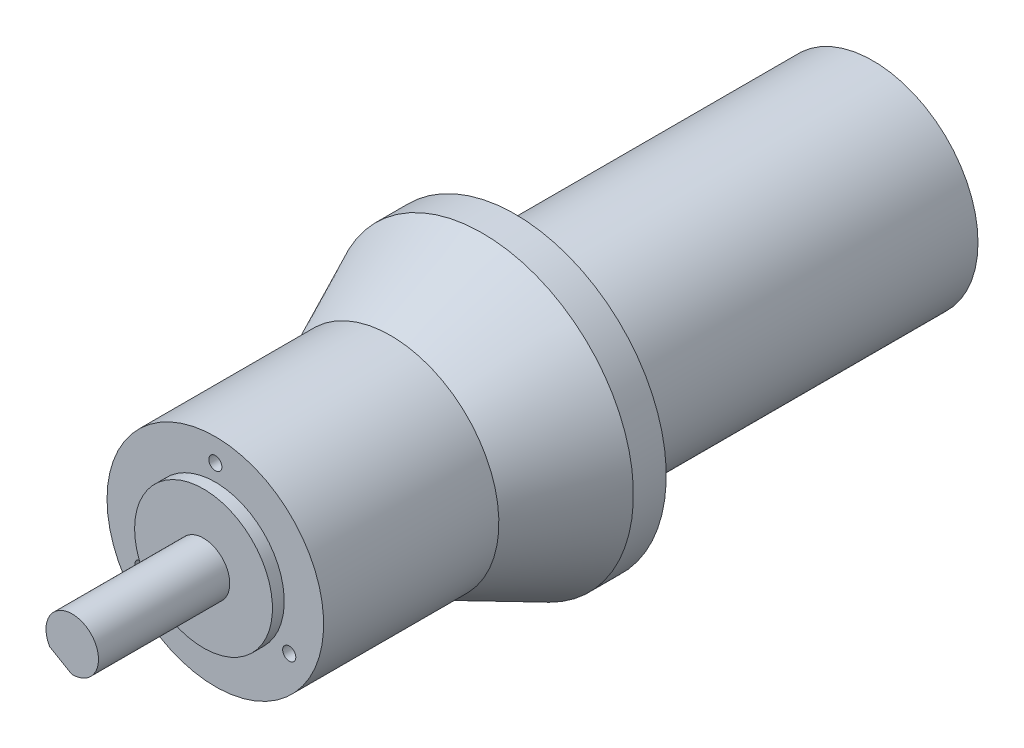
ISO-10303-21;
HEADER;
FILE_DESCRIPTION(('STEP AP214'),'2;1');
FILE_NAME('part.step','',(''),(''),'','','');
FILE_SCHEMA(('AUTOMOTIVE_DESIGN { 1 0 10303 214 1 1 1 1 }'));
ENDSEC;
DATA;
#1=APPLICATION_CONTEXT('core data for automotive mechanical design processes');
#2=APPLICATION_PROTOCOL_DEFINITION('international standard','automotive_design',2000,#1);
#3=PRODUCT_CONTEXT('',#1,'mechanical');
#4=PRODUCT('Part','Part','',(#3));
#5=PRODUCT_RELATED_PRODUCT_CATEGORY('part','',(#4));
#6=PRODUCT_DEFINITION_FORMATION('','',#4);
#7=PRODUCT_DEFINITION_CONTEXT('part definition',#1,'design');
#8=PRODUCT_DEFINITION('design','',#6,#7);
#9=PRODUCT_DEFINITION_SHAPE('','',#8);
#10=(LENGTH_UNIT() NAMED_UNIT(*) SI_UNIT(.MILLI.,.METRE.));
#11=(NAMED_UNIT(*) PLANE_ANGLE_UNIT() SI_UNIT($,.RADIAN.));
#12=(NAMED_UNIT(*) SI_UNIT($,.STERADIAN.) SOLID_ANGLE_UNIT());
#13=UNCERTAINTY_MEASURE_WITH_UNIT(LENGTH_MEASURE(1.E-05),#10,'distance_accuracy_value','');
#14=(GEOMETRIC_REPRESENTATION_CONTEXT(3) GLOBAL_UNCERTAINTY_ASSIGNED_CONTEXT((#13)) GLOBAL_UNIT_ASSIGNED_CONTEXT((#10,
#11,#12)) REPRESENTATION_CONTEXT('',''));
#15=CARTESIAN_POINT('',(0.,0.,0.));
#16=DIRECTION('',(0.,0.,1.));
#17=DIRECTION('',(1.,0.,0.));
#18=AXIS2_PLACEMENT_3D('',#15,#16,#17);
#19=CARTESIAN_POINT('',(6.910254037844,-8.031088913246,21.8));
#20=DIRECTION('',(0.500000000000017,0.866025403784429,0.));
#21=DIRECTION('',(-0.866025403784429,0.500000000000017,0.));
#22=AXIS2_PLACEMENT_3D('',#19,#20,#21);
#23=PLANE('',#22);
#24=DIRECTION('',(-0.866025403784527,0.499999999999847,0.));
#25=VECTOR('',#24,1.);
#26=CARTESIAN_POINT('',(-0.07294901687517,-3.999334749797,3.8));
#27=LINE('',#26,#25);
#28=CARTESIAN_POINT('',(-0.0729490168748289,-3.99933474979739,3.8));
#29=VERTEX_POINT('',#28);
#30=CARTESIAN_POINT('',(-3.4270509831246,-2.06284307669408,3.8));
#31=VERTEX_POINT('',#30);
#32=EDGE_CURVE('E34',#29,#31,#27,.T.);
#33=ORIENTED_EDGE('',*,*,#32,.F.);
#34=DIRECTION('',(0.,0.,-1.));
#35=VECTOR('',#34,1.);
#36=CARTESIAN_POINT('',(-0.0729490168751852,-3.99933474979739,22.89));
#37=LINE('',#36,#35);
#38=CARTESIAN_POINT('',(-0.0729490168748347,-3.99933474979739,21.8));
#39=VERTEX_POINT('',#38);
#40=EDGE_CURVE('E51',#39,#29,#37,.T.);
#41=ORIENTED_EDGE('',*,*,#40,.F.);
#42=DIRECTION('',(-0.866025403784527,0.499999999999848,0.));
#43=VECTOR('',#42,1.);
#44=CARTESIAN_POINT('',(-0.07294901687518,-3.999334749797,21.8));
#45=LINE('',#44,#43);
#46=CARTESIAN_POINT('',(-3.4270509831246,-2.06284307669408,21.8));
#47=VERTEX_POINT('',#46);
#48=EDGE_CURVE('E47',#39,#47,#45,.T.);
#49=ORIENTED_EDGE('',*,*,#48,.T.);
#50=DIRECTION('',(0.,0.,-1.));
#51=VECTOR('',#50,1.);
#52=CARTESIAN_POINT('',(-3.42705098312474,-2.06284307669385,22.89));
#53=LINE('',#52,#51);
#54=EDGE_CURVE('E41',#31,#47,#53,.F.);
#55=ORIENTED_EDGE('',*,*,#54,.F.);
#56=EDGE_LOOP('',(#33,#41,#49,#55));
#57=FACE_BOUND('',#56,.T.);
#58=ADVANCED_FACE('F16',(#57),#23,.F.);
#59=CARTESIAN_POINT('',(0.,0.,3.8));
#60=DIRECTION('',(0.,0.,1.));
#61=DIRECTION('',(1.,0.,0.));
#62=AXIS2_PLACEMENT_3D('',#59,#60,#61);
#63=PLANE('',#62);
#64=CARTESIAN_POINT('',(0.,0.,3.8));
#65=DIRECTION('',(0.,0.,-1.));
#66=DIRECTION('',(-1.,0.,0.));
#67=AXIS2_PLACEMENT_3D('',#64,#65,#66);
#68=CIRCLE('',#67,4.);
#69=EDGE_CURVE('E19',#29,#31,#68,.T.);
#70=ORIENTED_EDGE('',*,*,#69,.F.);
#71=ORIENTED_EDGE('',*,*,#32,.T.);
#72=EDGE_LOOP('',(#70,#71));
#73=FACE_BOUND('',#72,.T.);
#74=ADVANCED_FACE('F132',(#73),#63,.T.);
#75=CARTESIAN_POINT('',(0.,0.,21.8));
#76=DIRECTION('',(0.,0.,-1.));
#77=DIRECTION('',(-1.,0.,0.));
#78=AXIS2_PLACEMENT_3D('',#75,#76,#77);
#79=PLANE('',#78);
#80=CARTESIAN_POINT('',(0.,0.,21.8));
#81=DIRECTION('',(0.,0.,-1.));
#82=DIRECTION('',(-1.,0.,0.));
#83=AXIS2_PLACEMENT_3D('',#80,#81,#82);
#84=CIRCLE('',#83,4.);
#85=EDGE_CURVE('E45',#47,#39,#84,.T.);
#86=ORIENTED_EDGE('',*,*,#85,.F.);
#87=ORIENTED_EDGE('',*,*,#48,.F.);
#88=EDGE_LOOP('',(#86,#87));
#89=FACE_BOUND('',#88,.T.);
#90=ADVANCED_FACE('F46',(#89),#79,.F.);
#91=CARTESIAN_POINT('',(0.,0.,22.89));
#92=DIRECTION('',(0.,0.,-1.));
#93=DIRECTION('',(-1.,0.,0.));
#94=AXIS2_PLACEMENT_3D('',#91,#92,#93);
#95=CYLINDRICAL_SURFACE('',#94,4.);
#96=CARTESIAN_POINT('',(0.,0.,1.8));
#97=DIRECTION('',(0.,0.,-1.));
#98=DIRECTION('',(-1.,0.,0.));
#99=AXIS2_PLACEMENT_3D('',#96,#97,#98);
#100=CIRCLE('',#99,4.);
#101=CARTESIAN_POINT('',(-4.,0.,1.8));
#102=VERTEX_POINT('',#101);
#103=EDGE_CURVE('E50',#102,#102,#100,.F.);
#104=ORIENTED_EDGE('',*,*,#103,.T.);
#105=EDGE_LOOP('',(#104));
#106=FACE_BOUND('',#105,.T.);
#107=ORIENTED_EDGE('',*,*,#85,.T.);
#108=ORIENTED_EDGE('',*,*,#40,.T.);
#109=ORIENTED_EDGE('',*,*,#69,.T.);
#110=ORIENTED_EDGE('',*,*,#54,.T.);
#111=EDGE_LOOP('',(#107,#108,#109,#110));
#112=FACE_BOUND('',#111,.T.);
#113=ADVANCED_FACE('F54',(#106,#112),#95,.T.);
#114=CARTESIAN_POINT('',(0.,0.,1.8));
#115=DIRECTION('',(0.,0.,-1.));
#116=DIRECTION('',(-1.,0.,0.));
#117=AXIS2_PLACEMENT_3D('',#114,#115,#116);
#118=PLANE('',#117);
#119=ORIENTED_EDGE('',*,*,#103,.F.);
#120=EDGE_LOOP('',(#119));
#121=FACE_BOUND('',#120,.T.);
#122=CARTESIAN_POINT('',(0.,0.,1.8));
#123=DIRECTION('',(0.,0.,-1.));
#124=DIRECTION('',(-1.,0.,0.));
#125=AXIS2_PLACEMENT_3D('',#122,#123,#124);
#126=CIRCLE('',#125,10.5);
#127=CARTESIAN_POINT('',(-10.5,0.,1.8));
#128=VERTEX_POINT('',#127);
#129=EDGE_CURVE('E90',#128,#128,#126,.T.);
#130=ORIENTED_EDGE('',*,*,#129,.F.);
#131=EDGE_LOOP('',(#130));
#132=FACE_BOUND('',#131,.T.);
#133=ADVANCED_FACE('F97',(#121,#132),#118,.F.);
#134=CARTESIAN_POINT('',(-11.2583302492,-6.5,-6.));
#135=DIRECTION('',(0.,0.,-1.));
#136=DIRECTION('',(-1.,0.,0.));
#137=AXIS2_PLACEMENT_3D('',#134,#135,#136);
#138=PLANE('',#137);
#139=CARTESIAN_POINT('',(-11.2583302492,-6.5,-6.));
#140=DIRECTION('',(0.,0.,-1.));
#141=DIRECTION('',(-1.,0.,0.));
#142=AXIS2_PLACEMENT_3D('',#139,#140,#141);
#143=CIRCLE('',#142,1.);
#144=CARTESIAN_POINT('',(-12.2583302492,-6.5,-6.));
#145=VERTEX_POINT('',#144);
#146=EDGE_CURVE('E87',#145,#145,#143,.F.);
#147=ORIENTED_EDGE('',*,*,#146,.T.);
#148=EDGE_LOOP('',(#147));
#149=FACE_BOUND('',#148,.T.);
#150=ADVANCED_FACE('F100',(#149),#138,.F.);
#151=CARTESIAN_POINT('',(11.2583302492,-6.5,-6.));
#152=DIRECTION('',(0.,0.,-1.));
#153=DIRECTION('',(-1.,0.,0.));
#154=AXIS2_PLACEMENT_3D('',#151,#152,#153);
#155=PLANE('',#154);
#156=CARTESIAN_POINT('',(11.2583302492,-6.5,-6.));
#157=DIRECTION('',(0.,0.,-1.));
#158=DIRECTION('',(-1.,0.,0.));
#159=AXIS2_PLACEMENT_3D('',#156,#157,#158);
#160=CIRCLE('',#159,1.);
#161=CARTESIAN_POINT('',(10.2583302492,-6.5,-6.));
#162=VERTEX_POINT('',#161);
#163=EDGE_CURVE('E84',#162,#162,#160,.F.);
#164=ORIENTED_EDGE('',*,*,#163,.T.);
#165=EDGE_LOOP('',(#164));
#166=FACE_BOUND('',#165,.T.);
#167=ADVANCED_FACE('F174',(#166),#155,.F.);
#168=CARTESIAN_POINT('',(0.,13.,-6.));
#169=DIRECTION('',(0.,0.,-1.));
#170=DIRECTION('',(-1.,0.,0.));
#171=AXIS2_PLACEMENT_3D('',#168,#169,#170);
#172=PLANE('',#171);
#173=CARTESIAN_POINT('',(0.,13.,-6.));
#174=DIRECTION('',(0.,0.,-1.));
#175=DIRECTION('',(-1.,0.,0.));
#176=AXIS2_PLACEMENT_3D('',#173,#174,#175);
#177=CIRCLE('',#176,1.);
#178=CARTESIAN_POINT('',(-1.,13.,-6.));
#179=VERTEX_POINT('',#178);
#180=EDGE_CURVE('E81',#179,#179,#177,.F.);
#181=ORIENTED_EDGE('',*,*,#180,.T.);
#182=EDGE_LOOP('',(#181));
#183=FACE_BOUND('',#182,.T.);
#184=ADVANCED_FACE('F108',(#183),#172,.F.);
#185=CARTESIAN_POINT('',(0.,0.,22.89));
#186=DIRECTION('',(0.,0.,-1.));
#187=DIRECTION('',(-1.,0.,0.));
#188=AXIS2_PLACEMENT_3D('',#185,#186,#187);
#189=CYLINDRICAL_SURFACE('',#188,10.5);
#190=ORIENTED_EDGE('',*,*,#129,.T.);
#191=EDGE_LOOP('',(#190));
#192=FACE_BOUND('',#191,.T.);
#193=CARTESIAN_POINT('',(0.,0.,0.));
#194=DIRECTION('',(0.,0.,-1.));
#195=DIRECTION('',(-1.,0.,0.));
#196=AXIS2_PLACEMENT_3D('',#193,#194,#195);
#197=CIRCLE('',#196,10.5);
#198=CARTESIAN_POINT('',(-10.5,0.,0.));
#199=VERTEX_POINT('',#198);
#200=EDGE_CURVE('E78',#199,#199,#197,.F.);
#201=ORIENTED_EDGE('',*,*,#200,.T.);
#202=EDGE_LOOP('',(#201));
#203=FACE_BOUND('',#202,.T.);
#204=ADVANCED_FACE('F104',(#192,#203),#189,.T.);
#205=CARTESIAN_POINT('',(-11.2583302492,-6.5,0.));
#206=DIRECTION('',(0.,0.,-1.));
#207=DIRECTION('',(-1.,0.,0.));
#208=AXIS2_PLACEMENT_3D('',#205,#206,#207);
#209=CYLINDRICAL_SURFACE('',#208,1.);
#210=ORIENTED_EDGE('',*,*,#146,.F.);
#211=EDGE_LOOP('',(#210));
#212=FACE_BOUND('',#211,.T.);
#213=CARTESIAN_POINT('',(-11.2583302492,-6.5,0.));
#214=DIRECTION('',(0.,0.,-1.));
#215=DIRECTION('',(-1.,0.,0.));
#216=AXIS2_PLACEMENT_3D('',#213,#214,#215);
#217=CIRCLE('',#216,1.);
#218=CARTESIAN_POINT('',(-12.2583302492,-6.5,0.));
#219=VERTEX_POINT('',#218);
#220=EDGE_CURVE('E75',#219,#219,#217,.F.);
#221=ORIENTED_EDGE('',*,*,#220,.T.);
#222=EDGE_LOOP('',(#221));
#223=FACE_BOUND('',#222,.T.);
#224=ADVANCED_FACE('F107',(#212,#223),#209,.F.);
#225=CARTESIAN_POINT('',(11.2583302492,-6.5,0.));
#226=DIRECTION('',(0.,0.,-1.));
#227=DIRECTION('',(-1.,0.,0.));
#228=AXIS2_PLACEMENT_3D('',#225,#226,#227);
#229=CYLINDRICAL_SURFACE('',#228,1.);
#230=ORIENTED_EDGE('',*,*,#163,.F.);
#231=EDGE_LOOP('',(#230));
#232=FACE_BOUND('',#231,.T.);
#233=CARTESIAN_POINT('',(11.2583302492,-6.5,0.));
#234=DIRECTION('',(0.,0.,-1.));
#235=DIRECTION('',(-1.,0.,0.));
#236=AXIS2_PLACEMENT_3D('',#233,#234,#235);
#237=CIRCLE('',#236,1.);
#238=CARTESIAN_POINT('',(10.2583302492,-6.5,0.));
#239=VERTEX_POINT('',#238);
#240=EDGE_CURVE('E72',#239,#239,#237,.F.);
#241=ORIENTED_EDGE('',*,*,#240,.T.);
#242=EDGE_LOOP('',(#241));
#243=FACE_BOUND('',#242,.T.);
#244=ADVANCED_FACE('F164',(#232,#243),#229,.F.);
#245=CARTESIAN_POINT('',(0.,13.,0.));
#246=DIRECTION('',(0.,0.,-1.));
#247=DIRECTION('',(-1.,0.,0.));
#248=AXIS2_PLACEMENT_3D('',#245,#246,#247);
#249=CYLINDRICAL_SURFACE('',#248,1.);
#250=ORIENTED_EDGE('',*,*,#180,.F.);
#251=EDGE_LOOP('',(#250));
#252=FACE_BOUND('',#251,.T.);
#253=CARTESIAN_POINT('',(0.,13.,0.));
#254=DIRECTION('',(0.,0.,-1.));
#255=DIRECTION('',(-1.,0.,0.));
#256=AXIS2_PLACEMENT_3D('',#253,#254,#255);
#257=CIRCLE('',#256,1.);
#258=CARTESIAN_POINT('',(-1.,13.,0.));
#259=VERTEX_POINT('',#258);
#260=EDGE_CURVE('E69',#259,#259,#257,.F.);
#261=ORIENTED_EDGE('',*,*,#260,.T.);
#262=EDGE_LOOP('',(#261));
#263=FACE_BOUND('',#262,.T.);
#264=ADVANCED_FACE('F116',(#252,#263),#249,.F.);
#265=CARTESIAN_POINT('',(0.,0.,0.));
#266=DIRECTION('',(0.,0.,-1.));
#267=DIRECTION('',(-1.,0.,0.));
#268=AXIS2_PLACEMENT_3D('',#265,#266,#267);
#269=PLANE('',#268);
#270=ORIENTED_EDGE('',*,*,#260,.F.);
#271=EDGE_LOOP('',(#270));
#272=FACE_BOUND('',#271,.T.);
#273=ORIENTED_EDGE('',*,*,#240,.F.);
#274=EDGE_LOOP('',(#273));
#275=FACE_BOUND('',#274,.T.);
#276=ORIENTED_EDGE('',*,*,#220,.F.);
#277=EDGE_LOOP('',(#276));
#278=FACE_BOUND('',#277,.T.);
#279=ORIENTED_EDGE('',*,*,#200,.F.);
#280=EDGE_LOOP('',(#279));
#281=FACE_BOUND('',#280,.T.);
#282=CARTESIAN_POINT('',(0.,0.,0.));
#283=DIRECTION('',(0.,0.,-1.));
#284=DIRECTION('',(-1.,0.,0.));
#285=AXIS2_PLACEMENT_3D('',#282,#283,#284);
#286=CIRCLE('',#285,16.5);
#287=CARTESIAN_POINT('',(-16.5,0.,0.));
#288=VERTEX_POINT('',#287);
#289=EDGE_CURVE('E65',#288,#288,#286,.T.);
#290=ORIENTED_EDGE('',*,*,#289,.F.);
#291=EDGE_LOOP('',(#290));
#292=FACE_BOUND('',#291,.T.);
#293=ADVANCED_FACE('F112',(#272,#275,#278,#281,#292),#269,.F.);
#294=CARTESIAN_POINT('',(0.,0.,5.01));
#295=DIRECTION('',(0.,0.,-1.));
#296=DIRECTION('',(-1.,0.,0.));
#297=AXIS2_PLACEMENT_3D('',#294,#295,#296);
#298=CYLINDRICAL_SURFACE('',#297,16.5);
#299=ORIENTED_EDGE('',*,*,#289,.T.);
#300=EDGE_LOOP('',(#299));
#301=FACE_BOUND('',#300,.T.);
#302=CARTESIAN_POINT('',(0.,0.,-26.7));
#303=DIRECTION('',(0.,0.,-1.));
#304=DIRECTION('',(0.,-1.,0.));
#305=AXIS2_PLACEMENT_3D('',#302,#303,#304);
#306=CIRCLE('',#305,16.5);
#307=CARTESIAN_POINT('',(0.,-16.5,-26.7));
#308=VERTEX_POINT('',#307);
#309=EDGE_CURVE('E68',#308,#308,#306,.T.);
#310=ORIENTED_EDGE('',*,*,#309,.F.);
#311=EDGE_LOOP('',(#310));
#312=FACE_BOUND('',#311,.T.);
#313=ADVANCED_FACE('F115',(#301,#312),#298,.T.);
#314=CARTESIAN_POINT('',(0.,0.,-40.7));
#315=DIRECTION('',(0.,0.,-1.));
#316=DIRECTION('',(-1.,0.,0.));
#317=AXIS2_PLACEMENT_3D('',#314,#315,#316);
#318=CONICAL_SURFACE('',#317,23.,0.434670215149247);
#319=ORIENTED_EDGE('',*,*,#309,.T.);
#320=EDGE_LOOP('',(#319));
#321=FACE_BOUND('',#320,.T.);
#322=CARTESIAN_POINT('',(0.,0.,-40.7));
#323=DIRECTION('',(0.,0.,-1.));
#324=DIRECTION('',(-1.,0.,0.));
#325=AXIS2_PLACEMENT_3D('',#322,#323,#324);
#326=CIRCLE('',#325,23.);
#327=CARTESIAN_POINT('',(-23.,0.,-40.7));
#328=VERTEX_POINT('',#327);
#329=EDGE_CURVE('E64',#328,#328,#326,.T.);
#330=ORIENTED_EDGE('',*,*,#329,.F.);
#331=EDGE_LOOP('',(#330));
#332=FACE_BOUND('',#331,.T.);
#333=ADVANCED_FACE('F123',(#321,#332),#318,.T.);
#334=CARTESIAN_POINT('',(0.,0.,5.01));
#335=DIRECTION('',(0.,0.,-1.));
#336=DIRECTION('',(-1.,0.,0.));
#337=AXIS2_PLACEMENT_3D('',#334,#335,#336);
#338=CYLINDRICAL_SURFACE('',#337,23.);
#339=ORIENTED_EDGE('',*,*,#329,.T.);
#340=EDGE_LOOP('',(#339));
#341=FACE_BOUND('',#340,.T.);
#342=CARTESIAN_POINT('',(0.,0.,-45.7));
#343=DIRECTION('',(0.,0.,-1.));
#344=DIRECTION('',(-1.,0.,0.));
#345=AXIS2_PLACEMENT_3D('',#342,#343,#344);
#346=CIRCLE('',#345,23.);
#347=CARTESIAN_POINT('',(-23.,0.,-45.7));
#348=VERTEX_POINT('',#347);
#349=EDGE_CURVE('E61',#348,#348,#346,.T.);
#350=ORIENTED_EDGE('',*,*,#349,.F.);
#351=EDGE_LOOP('',(#350));
#352=FACE_BOUND('',#351,.T.);
#353=ADVANCED_FACE('F155',(#341,#352),#338,.T.);
#354=CARTESIAN_POINT('',(0.,0.,-100.2));
#355=DIRECTION('',(0.,0.,-1.));
#356=DIRECTION('',(-1.,0.,0.));
#357=AXIS2_PLACEMENT_3D('',#354,#355,#356);
#358=PLANE('',#357);
#359=CARTESIAN_POINT('',(0.,0.,-100.2));
#360=DIRECTION('',(0.,0.,-1.));
#361=DIRECTION('',(-1.,0.,0.));
#362=AXIS2_PLACEMENT_3D('',#359,#360,#361);
#363=CIRCLE('',#362,16.);
#364=CARTESIAN_POINT('',(-16.,0.,-100.2));
#365=VERTEX_POINT('',#364);
#366=EDGE_CURVE('E25',#365,#365,#363,.F.);
#367=ORIENTED_EDGE('',*,*,#366,.F.);
#368=EDGE_LOOP('',(#367));
#369=FACE_BOUND('',#368,.T.);
#370=ADVANCED_FACE('F148',(#369),#358,.T.);
#371=CARTESIAN_POINT('',(0.,0.,-45.7));
#372=DIRECTION('',(0.,0.,-1.));
#373=DIRECTION('',(-1.,0.,0.));
#374=AXIS2_PLACEMENT_3D('',#371,#372,#373);
#375=PLANE('',#374);
#376=CARTESIAN_POINT('',(0.,0.,-45.7));
#377=DIRECTION('',(0.,0.,-1.));
#378=DIRECTION('',(-1.,0.,0.));
#379=AXIS2_PLACEMENT_3D('',#376,#377,#378);
#380=CIRCLE('',#379,16.);
#381=CARTESIAN_POINT('',(-16.,0.,-45.7));
#382=VERTEX_POINT('',#381);
#383=EDGE_CURVE('E11',#382,#382,#380,.T.);
#384=ORIENTED_EDGE('',*,*,#383,.F.);
#385=EDGE_LOOP('',(#384));
#386=FACE_BOUND('',#385,.T.);
#387=ORIENTED_EDGE('',*,*,#349,.T.);
#388=EDGE_LOOP('',(#387));
#389=FACE_BOUND('',#388,.T.);
#390=ADVANCED_FACE('F142',(#386,#389),#375,.T.);
#391=CARTESIAN_POINT('',(0.,0.,5.01));
#392=DIRECTION('',(0.,0.,-1.));
#393=DIRECTION('',(-1.,0.,0.));
#394=AXIS2_PLACEMENT_3D('',#391,#392,#393);
#395=CYLINDRICAL_SURFACE('',#394,16.);
#396=ORIENTED_EDGE('',*,*,#383,.T.);
#397=EDGE_LOOP('',(#396));
#398=FACE_BOUND('',#397,.T.);
#399=ORIENTED_EDGE('',*,*,#366,.T.);
#400=EDGE_LOOP('',(#399));
#401=FACE_BOUND('',#400,.T.);
#402=ADVANCED_FACE('F140',(#398,#401),#395,.T.);
#403=CLOSED_SHELL('',(#58,#74,#90,#113,#133,#150,#167,#184,#204,#224,#244,#264,#293,#313,#333,
#353,#370,#390,#402));
#404=MANIFOLD_SOLID_BREP('B1',#403);
#405=ADVANCED_BREP_SHAPE_REPRESENTATION('',(#18,#404),#14);
#406=SHAPE_DEFINITION_REPRESENTATION(#9,#405);
ENDSEC;
END-ISO-10303-21;
